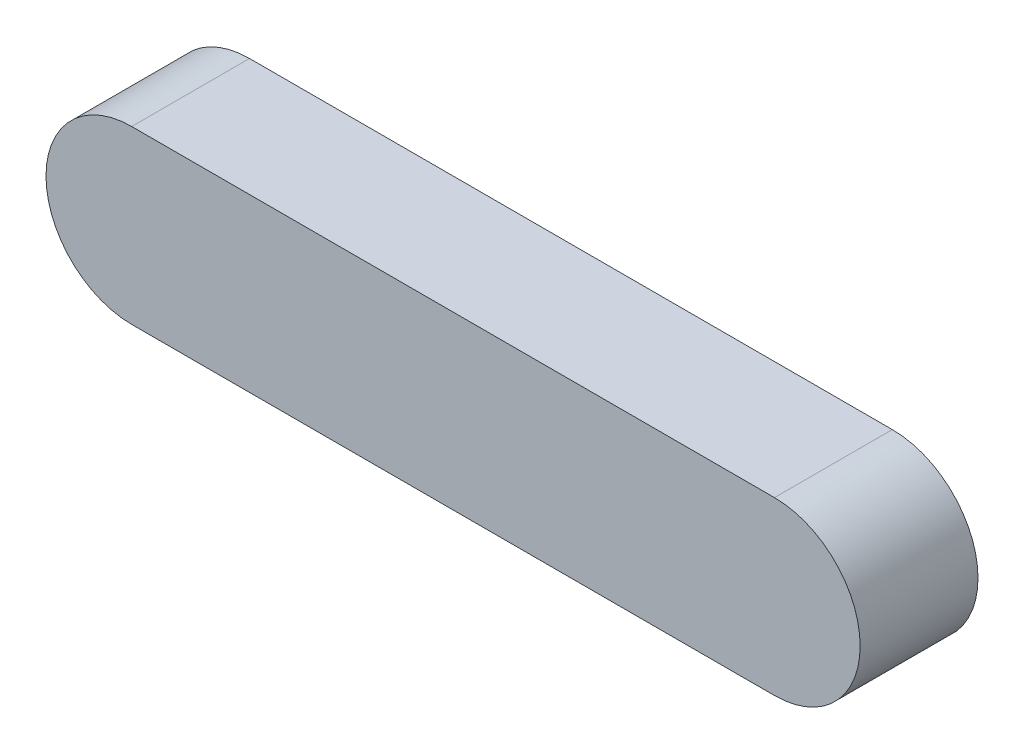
ISO-10303-21;
HEADER;
FILE_DESCRIPTION(('STEP AP214'),'2;1');
FILE_NAME('part.step','',(''),(''),'','','');
FILE_SCHEMA(('AUTOMOTIVE_DESIGN { 1 0 10303 214 1 1 1 1 }'));
ENDSEC;
DATA;
#1=APPLICATION_CONTEXT('core data for automotive mechanical design processes');
#2=APPLICATION_PROTOCOL_DEFINITION('international standard','automotive_design',2000,#1);
#3=PRODUCT_CONTEXT('',#1,'mechanical');
#4=PRODUCT('Part','Part','',(#3));
#5=PRODUCT_RELATED_PRODUCT_CATEGORY('part','',(#4));
#6=PRODUCT_DEFINITION_FORMATION('','',#4);
#7=PRODUCT_DEFINITION_CONTEXT('part definition',#1,'design');
#8=PRODUCT_DEFINITION('design','',#6,#7);
#9=PRODUCT_DEFINITION_SHAPE('','',#8);
#10=(LENGTH_UNIT() NAMED_UNIT(*) SI_UNIT(.MILLI.,.METRE.));
#11=(NAMED_UNIT(*) PLANE_ANGLE_UNIT() SI_UNIT($,.RADIAN.));
#12=(NAMED_UNIT(*) SI_UNIT($,.STERADIAN.) SOLID_ANGLE_UNIT());
#13=UNCERTAINTY_MEASURE_WITH_UNIT(LENGTH_MEASURE(1.E-05),#10,'distance_accuracy_value','');
#14=(GEOMETRIC_REPRESENTATION_CONTEXT(3) GLOBAL_UNCERTAINTY_ASSIGNED_CONTEXT((#13)) GLOBAL_UNIT_ASSIGNED_CONTEXT((#10,
#11,#12)) REPRESENTATION_CONTEXT('',''));
#15=CARTESIAN_POINT('',(0.,0.,0.));
#16=DIRECTION('',(0.,0.,1.));
#17=DIRECTION('',(1.,0.,0.));
#18=AXIS2_PLACEMENT_3D('',#15,#16,#17);
#19=CARTESIAN_POINT('',(-60.,54.,5.5));
#20=DIRECTION('',(0.,0.,-1.));
#21=DIRECTION('',(-1.,0.,0.));
#22=AXIS2_PLACEMENT_3D('',#19,#20,#21);
#23=CYLINDRICAL_SURFACE('',#22,4.00000000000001);
#24=CARTESIAN_POINT('',(-60.,54.,0.));
#25=DIRECTION('',(0.,0.,1.));
#26=DIRECTION('',(1.,0.,0.));
#27=AXIS2_PLACEMENT_3D('',#24,#25,#26);
#28=CIRCLE('',#27,4.00000000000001);
#29=CARTESIAN_POINT('',(-60.,58.,0.));
#30=VERTEX_POINT('',#29);
#31=CARTESIAN_POINT('',(-60.,50.,0.));
#32=VERTEX_POINT('',#31);
#33=EDGE_CURVE('E79',#30,#32,#28,.T.);
#34=ORIENTED_EDGE('',*,*,#33,.T.);
#35=DIRECTION('',(0.,0.,-1.));
#36=VECTOR('',#35,1.);
#37=CARTESIAN_POINT('',(-60.,50.,5.5));
#38=LINE('',#37,#36);
#39=CARTESIAN_POINT('',(-60.,50.,5.5));
#40=VERTEX_POINT('',#39);
#41=EDGE_CURVE('E11',#40,#32,#38,.T.);
#42=ORIENTED_EDGE('',*,*,#41,.F.);
#43=CARTESIAN_POINT('',(-60.,54.,5.5));
#44=DIRECTION('',(0.,0.,1.));
#45=DIRECTION('',(1.,0.,0.));
#46=AXIS2_PLACEMENT_3D('',#43,#44,#45);
#47=CIRCLE('',#46,4.00000000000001);
#48=CARTESIAN_POINT('',(-60.,58.,5.5));
#49=VERTEX_POINT('',#48);
#50=EDGE_CURVE('E94',#49,#40,#47,.T.);
#51=ORIENTED_EDGE('',*,*,#50,.F.);
#52=DIRECTION('',(0.,0.,-1.));
#53=VECTOR('',#52,1.);
#54=CARTESIAN_POINT('',(-60.,58.,5.5));
#55=LINE('',#54,#53);
#56=EDGE_CURVE('E46',#49,#30,#55,.T.);
#57=ORIENTED_EDGE('',*,*,#56,.T.);
#58=EDGE_LOOP('',(#34,#42,#51,#57));
#59=FACE_BOUND('',#58,.T.);
#60=ADVANCED_FACE('F32',(#59),#23,.T.);
#61=CARTESIAN_POINT('',(-60.,50.,5.5));
#62=DIRECTION('',(0.,1.,0.));
#63=DIRECTION('',(0.,0.,1.));
#64=AXIS2_PLACEMENT_3D('',#61,#62,#63);
#65=PLANE('',#64);
#66=DIRECTION('',(1.,0.,0.));
#67=VECTOR('',#66,1.);
#68=CARTESIAN_POINT('',(-60.,50.,0.));
#69=LINE('',#68,#67);
#70=CARTESIAN_POINT('',(-30.,50.,0.));
#71=VERTEX_POINT('',#70);
#72=EDGE_CURVE('E75',#32,#71,#69,.T.);
#73=ORIENTED_EDGE('',*,*,#72,.T.);
#74=DIRECTION('',(0.,0.,-1.));
#75=VECTOR('',#74,1.);
#76=CARTESIAN_POINT('',(-30.,50.,5.5));
#77=LINE('',#76,#75);
#78=CARTESIAN_POINT('',(-30.,50.,5.5));
#79=VERTEX_POINT('',#78);
#80=EDGE_CURVE('E39',#79,#71,#77,.T.);
#81=ORIENTED_EDGE('',*,*,#80,.F.);
#82=DIRECTION('',(1.,0.,0.));
#83=VECTOR('',#82,1.);
#84=CARTESIAN_POINT('',(-60.,50.,5.5));
#85=LINE('',#84,#83);
#86=EDGE_CURVE('E86',#40,#79,#85,.T.);
#87=ORIENTED_EDGE('',*,*,#86,.F.);
#88=ORIENTED_EDGE('',*,*,#41,.T.);
#89=EDGE_LOOP('',(#73,#81,#87,#88));
#90=FACE_BOUND('',#89,.T.);
#91=ADVANCED_FACE('F85',(#90),#65,.F.);
#92=CARTESIAN_POINT('',(-30.,54.,5.5));
#93=DIRECTION('',(0.,0.,-1.));
#94=DIRECTION('',(-1.,0.,0.));
#95=AXIS2_PLACEMENT_3D('',#92,#93,#94);
#96=CYLINDRICAL_SURFACE('',#95,4.);
#97=CARTESIAN_POINT('',(-30.,54.,0.));
#98=DIRECTION('',(0.,0.,-1.));
#99=DIRECTION('',(-1.,0.,0.));
#100=AXIS2_PLACEMENT_3D('',#97,#98,#99);
#101=CIRCLE('',#100,4.);
#102=CARTESIAN_POINT('',(-30.,58.,0.));
#103=VERTEX_POINT('',#102);
#104=EDGE_CURVE('E80',#103,#71,#101,.T.);
#105=ORIENTED_EDGE('',*,*,#104,.F.);
#106=DIRECTION('',(0.,0.,-1.));
#107=VECTOR('',#106,1.);
#108=CARTESIAN_POINT('',(-30.,58.,5.5));
#109=LINE('',#108,#107);
#110=CARTESIAN_POINT('',(-30.,58.,5.5));
#111=VERTEX_POINT('',#110);
#112=EDGE_CURVE('E54',#111,#103,#109,.T.);
#113=ORIENTED_EDGE('',*,*,#112,.F.);
#114=CARTESIAN_POINT('',(-30.,54.,5.5));
#115=DIRECTION('',(0.,0.,-1.));
#116=DIRECTION('',(-1.,0.,0.));
#117=AXIS2_PLACEMENT_3D('',#114,#115,#116);
#118=CIRCLE('',#117,4.);
#119=EDGE_CURVE('E97',#111,#79,#118,.T.);
#120=ORIENTED_EDGE('',*,*,#119,.T.);
#121=ORIENTED_EDGE('',*,*,#80,.T.);
#122=EDGE_LOOP('',(#105,#113,#120,#121));
#123=FACE_BOUND('',#122,.T.);
#124=ADVANCED_FACE('F102',(#123),#96,.T.);
#125=CARTESIAN_POINT('',(-60.,58.,5.5));
#126=DIRECTION('',(0.,1.,0.));
#127=DIRECTION('',(-1.,0.,0.));
#128=AXIS2_PLACEMENT_3D('',#125,#126,#127);
#129=PLANE('',#128);
#130=DIRECTION('',(1.,0.,0.));
#131=VECTOR('',#130,1.);
#132=CARTESIAN_POINT('',(-60.,58.,0.));
#133=LINE('',#132,#131);
#134=EDGE_CURVE('E92',#30,#103,#133,.T.);
#135=ORIENTED_EDGE('',*,*,#134,.F.);
#136=ORIENTED_EDGE('',*,*,#56,.F.);
#137=DIRECTION('',(1.,0.,0.));
#138=VECTOR('',#137,1.);
#139=CARTESIAN_POINT('',(-60.,58.,5.5));
#140=LINE('',#139,#138);
#141=EDGE_CURVE('E99',#49,#111,#140,.T.);
#142=ORIENTED_EDGE('',*,*,#141,.T.);
#143=ORIENTED_EDGE('',*,*,#112,.T.);
#144=EDGE_LOOP('',(#135,#136,#142,#143));
#145=FACE_BOUND('',#144,.T.);
#146=ADVANCED_FACE('F106',(#145),#129,.T.);
#147=CARTESIAN_POINT('',(-60.,54.,5.5));
#148=DIRECTION('',(0.,0.,1.));
#149=DIRECTION('',(1.,0.,0.));
#150=AXIS2_PLACEMENT_3D('',#147,#148,#149);
#151=PLANE('',#150);
#152=ORIENTED_EDGE('',*,*,#50,.T.);
#153=ORIENTED_EDGE('',*,*,#86,.T.);
#154=ORIENTED_EDGE('',*,*,#119,.F.);
#155=ORIENTED_EDGE('',*,*,#141,.F.);
#156=EDGE_LOOP('',(#152,#153,#154,#155));
#157=FACE_BOUND('',#156,.T.);
#158=ADVANCED_FACE('F105',(#157),#151,.T.);
#159=CARTESIAN_POINT('',(-60.,54.,0.));
#160=DIRECTION('',(0.,0.,1.));
#161=DIRECTION('',(1.,0.,0.));
#162=AXIS2_PLACEMENT_3D('',#159,#160,#161);
#163=PLANE('',#162);
#164=ORIENTED_EDGE('',*,*,#33,.F.);
#165=ORIENTED_EDGE('',*,*,#134,.T.);
#166=ORIENTED_EDGE('',*,*,#104,.T.);
#167=ORIENTED_EDGE('',*,*,#72,.F.);
#168=EDGE_LOOP('',(#164,#165,#166,#167));
#169=FACE_BOUND('',#168,.T.);
#170=ADVANCED_FACE('F76',(#169),#163,.F.);
#171=CLOSED_SHELL('',(#60,#91,#124,#146,#158,#170));
#172=MANIFOLD_SOLID_BREP('B2',#171);
#173=ADVANCED_BREP_SHAPE_REPRESENTATION('',(#18,#172),#14);
#174=SHAPE_DEFINITION_REPRESENTATION(#9,#173);
ENDSEC;
END-ISO-10303-21;
